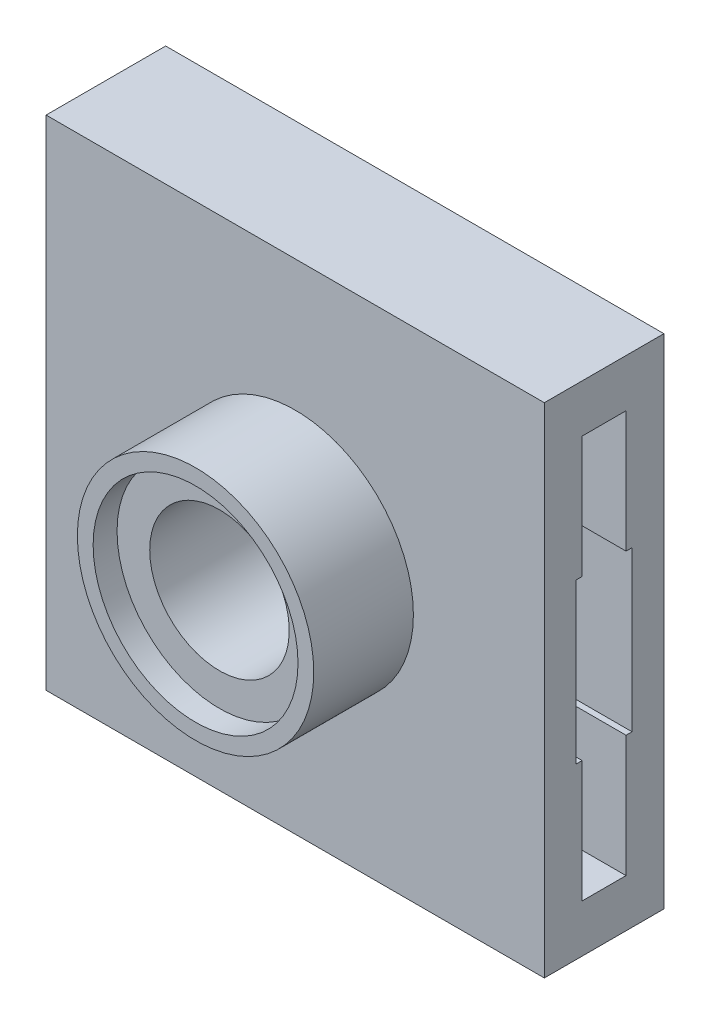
ISO-10303-21;
HEADER;
FILE_DESCRIPTION(('STEP AP214'),'2;1');
FILE_NAME('part.step','',(''),(''),'','','');
FILE_SCHEMA(('AUTOMOTIVE_DESIGN { 1 0 10303 214 1 1 1 1 }'));
ENDSEC;
DATA;
#1=APPLICATION_CONTEXT('core data for automotive mechanical design processes');
#2=APPLICATION_PROTOCOL_DEFINITION('international standard','automotive_design',2000,#1);
#3=PRODUCT_CONTEXT('',#1,'mechanical');
#4=PRODUCT('Part','Part','',(#3));
#5=PRODUCT_RELATED_PRODUCT_CATEGORY('part','',(#4));
#6=PRODUCT_DEFINITION_FORMATION('','',#4);
#7=PRODUCT_DEFINITION_CONTEXT('part definition',#1,'design');
#8=PRODUCT_DEFINITION('design','',#6,#7);
#9=PRODUCT_DEFINITION_SHAPE('','',#8);
#10=(LENGTH_UNIT() NAMED_UNIT(*) SI_UNIT(.MILLI.,.METRE.));
#11=(NAMED_UNIT(*) PLANE_ANGLE_UNIT() SI_UNIT($,.RADIAN.));
#12=(NAMED_UNIT(*) SI_UNIT($,.STERADIAN.) SOLID_ANGLE_UNIT());
#13=UNCERTAINTY_MEASURE_WITH_UNIT(LENGTH_MEASURE(1.E-05),#10,'distance_accuracy_value','');
#14=(GEOMETRIC_REPRESENTATION_CONTEXT(3) GLOBAL_UNCERTAINTY_ASSIGNED_CONTEXT((#13)) GLOBAL_UNIT_ASSIGNED_CONTEXT((#10,
#11,#12)) REPRESENTATION_CONTEXT('',''));
#15=CARTESIAN_POINT('',(0.,0.,0.));
#16=DIRECTION('',(0.,0.,1.));
#17=DIRECTION('',(1.,0.,0.));
#18=AXIS2_PLACEMENT_3D('',#15,#16,#17);
#19=CARTESIAN_POINT('',(-5.05,5.05,2.05));
#20=DIRECTION('',(1.,0.,0.));
#21=DIRECTION('',(0.,1.,0.));
#22=AXIS2_PLACEMENT_3D('',#19,#20,#21);
#23=PLANE('',#22);
#24=DIRECTION('',(0.,0.,1.));
#25=VECTOR('',#24,1.);
#26=CARTESIAN_POINT('',(-5.05,3.5,2.05));
#27=LINE('',#26,#25);
#28=CARTESIAN_POINT('',(-5.05,3.5,0.95));
#29=VERTEX_POINT('',#28);
#30=CARTESIAN_POINT('',(-5.05,3.5,2.05));
#31=VERTEX_POINT('',#30);
#32=EDGE_CURVE('E174',#29,#31,#27,.T.);
#33=ORIENTED_EDGE('',*,*,#32,.F.);
#34=DIRECTION('',(0.,-1.,0.));
#35=VECTOR('',#34,1.);
#36=CARTESIAN_POINT('',(-5.05,5.05,0.95));
#37=LINE('',#36,#35);
#38=CARTESIAN_POINT('',(-5.05,5.05,0.95));
#39=VERTEX_POINT('',#38);
#40=EDGE_CURVE('E186',#39,#29,#37,.T.);
#41=ORIENTED_EDGE('',*,*,#40,.F.);
#42=DIRECTION('',(0.,0.,-1.));
#43=VECTOR('',#42,1.);
#44=CARTESIAN_POINT('',(-5.05,5.05,2.05));
#45=LINE('',#44,#43);
#46=CARTESIAN_POINT('',(-5.05,5.05,2.05));
#47=VERTEX_POINT('',#46);
#48=EDGE_CURVE('E220',#47,#39,#45,.T.);
#49=ORIENTED_EDGE('',*,*,#48,.F.);
#50=DIRECTION('',(0.,-1.,0.));
#51=VECTOR('',#50,1.);
#52=CARTESIAN_POINT('',(-5.05,5.05,2.05));
#53=LINE('',#52,#51);
#54=EDGE_CURVE('E189',#47,#31,#53,.T.);
#55=ORIENTED_EDGE('',*,*,#54,.T.);
#56=EDGE_LOOP('',(#33,#41,#49,#55));
#57=FACE_BOUND('',#56,.T.);
#58=ADVANCED_FACE('F32',(#57),#23,.T.);
#59=CARTESIAN_POINT('',(-6.25,-6.25,3.));
#60=DIRECTION('',(1.,0.,0.));
#61=DIRECTION('',(0.,0.,-1.));
#62=AXIS2_PLACEMENT_3D('',#59,#60,#61);
#63=PLANE('',#62);
#64=DIRECTION('',(0.,-1.,0.));
#65=VECTOR('',#64,1.);
#66=CARTESIAN_POINT('',(-6.25,-6.25,0.));
#67=LINE('',#66,#65);
#68=CARTESIAN_POINT('',(-6.25,6.25,0.));
#69=VERTEX_POINT('',#68);
#70=CARTESIAN_POINT('',(-6.25,-6.25,0.));
#71=VERTEX_POINT('',#70);
#72=EDGE_CURVE('E241',#69,#71,#67,.T.);
#73=ORIENTED_EDGE('',*,*,#72,.T.);
#74=DIRECTION('',(0.,0.,-1.));
#75=VECTOR('',#74,1.);
#76=CARTESIAN_POINT('',(-6.25,-6.25,3.));
#77=LINE('',#76,#75);
#78=CARTESIAN_POINT('',(-6.25,-6.25,3.));
#79=VERTEX_POINT('',#78);
#80=EDGE_CURVE('E270',#79,#71,#77,.T.);
#81=ORIENTED_EDGE('',*,*,#80,.F.);
#82=DIRECTION('',(0.,-1.,0.));
#83=VECTOR('',#82,1.);
#84=CARTESIAN_POINT('',(-6.25,-6.25,3.));
#85=LINE('',#84,#83);
#86=CARTESIAN_POINT('',(-6.25,6.25,3.));
#87=VERTEX_POINT('',#86);
#88=EDGE_CURVE('E244',#87,#79,#85,.T.);
#89=ORIENTED_EDGE('',*,*,#88,.F.);
#90=DIRECTION('',(0.,0.,-1.));
#91=VECTOR('',#90,1.);
#92=CARTESIAN_POINT('',(-6.25,6.25,3.));
#93=LINE('',#92,#91);
#94=EDGE_CURVE('E254',#87,#69,#93,.T.);
#95=ORIENTED_EDGE('',*,*,#94,.T.);
#96=EDGE_LOOP('',(#73,#81,#89,#95));
#97=FACE_BOUND('',#96,.T.);
#98=DIRECTION('',(0.,1.,0.));
#99=VECTOR('',#98,1.);
#100=CARTESIAN_POINT('',(-6.25,3.5,0.95));
#101=LINE('',#100,#99);
#102=CARTESIAN_POINT('',(-6.25,-3.5,0.95));
#103=VERTEX_POINT('',#102);
#104=CARTESIAN_POINT('',(-6.25,3.5,0.95));
#105=VERTEX_POINT('',#104);
#106=EDGE_CURVE('E57',#103,#105,#101,.T.);
#107=ORIENTED_EDGE('',*,*,#106,.T.);
#108=DIRECTION('',(0.,0.,1.));
#109=VECTOR('',#108,1.);
#110=CARTESIAN_POINT('',(-6.25,3.5,2.05));
#111=LINE('',#110,#109);
#112=CARTESIAN_POINT('',(-6.25,3.5,2.05));
#113=VERTEX_POINT('',#112);
#114=EDGE_CURVE('E177',#105,#113,#111,.T.);
#115=ORIENTED_EDGE('',*,*,#114,.T.);
#116=DIRECTION('',(0.,-1.,0.));
#117=VECTOR('',#116,1.);
#118=CARTESIAN_POINT('',(-6.25,3.5,2.05));
#119=LINE('',#118,#117);
#120=CARTESIAN_POINT('',(-6.25,-3.5,2.05));
#121=VERTEX_POINT('',#120);
#122=EDGE_CURVE('E300',#113,#121,#119,.T.);
#123=ORIENTED_EDGE('',*,*,#122,.T.);
#124=DIRECTION('',(0.,0.,-1.));
#125=VECTOR('',#124,1.);
#126=CARTESIAN_POINT('',(-6.25,-3.5,2.05));
#127=LINE('',#126,#125);
#128=EDGE_CURVE('E191',#121,#103,#127,.T.);
#129=ORIENTED_EDGE('',*,*,#128,.T.);
#130=EDGE_LOOP('',(#107,#115,#123,#129));
#131=FACE_BOUND('',#130,.T.);
#132=ADVANCED_FACE('F34',(#97,#131),#63,.F.);
#133=CARTESIAN_POINT('',(6.25,-6.25,3.));
#134=DIRECTION('',(-1.,0.,0.));
#135=DIRECTION('',(0.,0.,1.));
#136=AXIS2_PLACEMENT_3D('',#133,#134,#135);
#137=PLANE('',#136);
#138=DIRECTION('',(0.,1.,0.));
#139=VECTOR('',#138,1.);
#140=CARTESIAN_POINT('',(6.25,-6.25,0.));
#141=LINE('',#140,#139);
#142=CARTESIAN_POINT('',(6.25,-6.25,0.));
#143=VERTEX_POINT('',#142);
#144=CARTESIAN_POINT('',(6.25,6.25,0.));
#145=VERTEX_POINT('',#144);
#146=EDGE_CURVE('E259',#143,#145,#141,.T.);
#147=ORIENTED_EDGE('',*,*,#146,.T.);
#148=DIRECTION('',(0.,0.,-1.));
#149=VECTOR('',#148,1.);
#150=CARTESIAN_POINT('',(6.25,6.25,3.));
#151=LINE('',#150,#149);
#152=CARTESIAN_POINT('',(6.25,6.25,3.));
#153=VERTEX_POINT('',#152);
#154=EDGE_CURVE('E264',#153,#145,#151,.T.);
#155=ORIENTED_EDGE('',*,*,#154,.F.);
#156=DIRECTION('',(0.,1.,0.));
#157=VECTOR('',#156,1.);
#158=CARTESIAN_POINT('',(6.25,-6.25,3.));
#159=LINE('',#158,#157);
#160=CARTESIAN_POINT('',(6.25,-6.25,3.));
#161=VERTEX_POINT('',#160);
#162=EDGE_CURVE('E250',#161,#153,#159,.T.);
#163=ORIENTED_EDGE('',*,*,#162,.F.);
#164=DIRECTION('',(0.,0.,-1.));
#165=VECTOR('',#164,1.);
#166=CARTESIAN_POINT('',(6.25,-6.25,3.));
#167=LINE('',#166,#165);
#168=EDGE_CURVE('E267',#161,#143,#167,.T.);
#169=ORIENTED_EDGE('',*,*,#168,.T.);
#170=EDGE_LOOP('',(#147,#155,#163,#169));
#171=FACE_BOUND('',#170,.T.);
#172=DIRECTION('',(0.,0.,-1.));
#173=VECTOR('',#172,1.);
#174=CARTESIAN_POINT('',(6.25,2.,2.2));
#175=LINE('',#174,#173);
#176=CARTESIAN_POINT('',(6.25,2.,2.2));
#177=VERTEX_POINT('',#176);
#178=CARTESIAN_POINT('',(6.25,2.,2.05));
#179=VERTEX_POINT('',#178);
#180=EDGE_CURVE('E340',#177,#179,#175,.T.);
#181=ORIENTED_EDGE('',*,*,#180,.T.);
#182=DIRECTION('',(0.,1.,0.));
#183=VECTOR('',#182,1.);
#184=CARTESIAN_POINT('',(6.25,5.05,2.05));
#185=LINE('',#184,#183);
#186=CARTESIAN_POINT('',(6.25,5.05,2.05));
#187=VERTEX_POINT('',#186);
#188=EDGE_CURVE('E214',#179,#187,#185,.T.);
#189=ORIENTED_EDGE('',*,*,#188,.T.);
#190=DIRECTION('',(0.,0.,-1.));
#191=VECTOR('',#190,1.);
#192=CARTESIAN_POINT('',(6.25,5.05,2.05));
#193=LINE('',#192,#191);
#194=CARTESIAN_POINT('',(6.25,5.05,0.95));
#195=VERTEX_POINT('',#194);
#196=EDGE_CURVE('E222',#187,#195,#193,.T.);
#197=ORIENTED_EDGE('',*,*,#196,.T.);
#198=DIRECTION('',(0.,1.,0.));
#199=VECTOR('',#198,1.);
#200=CARTESIAN_POINT('',(6.25,5.05,0.95));
#201=LINE('',#200,#199);
#202=CARTESIAN_POINT('',(6.25,2.,0.95));
#203=VERTEX_POINT('',#202);
#204=EDGE_CURVE('E200',#203,#195,#201,.T.);
#205=ORIENTED_EDGE('',*,*,#204,.F.);
#206=CARTESIAN_POINT('',(6.25,2.,0.8));
#207=VERTEX_POINT('',#206);
#208=EDGE_CURVE('E339',#203,#207,#175,.T.);
#209=ORIENTED_EDGE('',*,*,#208,.T.);
#210=DIRECTION('',(0.,1.,0.));
#211=VECTOR('',#210,1.);
#212=CARTESIAN_POINT('',(6.25,2.,0.8));
#213=LINE('',#212,#211);
#214=CARTESIAN_POINT('',(6.25,-2.,0.8));
#215=VERTEX_POINT('',#214);
#216=EDGE_CURVE('E179',#215,#207,#213,.T.);
#217=ORIENTED_EDGE('',*,*,#216,.F.);
#218=DIRECTION('',(0.,0.,-1.));
#219=VECTOR('',#218,1.);
#220=CARTESIAN_POINT('',(6.25,-2.,2.2));
#221=LINE('',#220,#219);
#222=CARTESIAN_POINT('',(6.25,-2.,0.95));
#223=VERTEX_POINT('',#222);
#224=EDGE_CURVE('E328',#223,#215,#221,.T.);
#225=ORIENTED_EDGE('',*,*,#224,.F.);
#226=CARTESIAN_POINT('',(6.25,-5.05,0.95));
#227=VERTEX_POINT('',#226);
#228=EDGE_CURVE('E206',#227,#223,#201,.T.);
#229=ORIENTED_EDGE('',*,*,#228,.F.);
#230=DIRECTION('',(0.,0.,-1.));
#231=VECTOR('',#230,1.);
#232=CARTESIAN_POINT('',(6.25,-5.05,2.05));
#233=LINE('',#232,#231);
#234=CARTESIAN_POINT('',(6.25,-5.05,2.05));
#235=VERTEX_POINT('',#234);
#236=EDGE_CURVE('E225',#235,#227,#233,.T.);
#237=ORIENTED_EDGE('',*,*,#236,.F.);
#238=CARTESIAN_POINT('',(6.25,-2.,2.05));
#239=VERTEX_POINT('',#238);
#240=EDGE_CURVE('E215',#235,#239,#185,.T.);
#241=ORIENTED_EDGE('',*,*,#240,.T.);
#242=CARTESIAN_POINT('',(6.25,-2.,2.2));
#243=VERTEX_POINT('',#242);
#244=EDGE_CURVE('E329',#243,#239,#221,.T.);
#245=ORIENTED_EDGE('',*,*,#244,.F.);
#246=DIRECTION('',(0.,1.,0.));
#247=VECTOR('',#246,1.);
#248=CARTESIAN_POINT('',(6.25,2.,2.2));
#249=LINE('',#248,#247);
#250=EDGE_CURVE('E319',#243,#177,#249,.T.);
#251=ORIENTED_EDGE('',*,*,#250,.T.);
#252=EDGE_LOOP('',(#181,#189,#197,#205,#209,#217,#225,#229,#237,#241,#245,#251));
#253=FACE_BOUND('',#252,.T.);
#254=ADVANCED_FACE('F355',(#171,#253),#137,.F.);
#255=CARTESIAN_POINT('',(0.,0.,-2.5));
#256=DIRECTION('',(0.,0.,1.));
#257=DIRECTION('',(1.,0.,0.));
#258=AXIS2_PLACEMENT_3D('',#255,#256,#257);
#259=CYLINDRICAL_SURFACE('',#258,1.75);
#260=CARTESIAN_POINT('',(0.,0.,4.9));
#261=DIRECTION('',(0.,0.,-1.));
#262=DIRECTION('',(-1.,0.,0.));
#263=AXIS2_PLACEMENT_3D('',#260,#261,#262);
#264=CIRCLE('',#263,1.75);
#265=CARTESIAN_POINT('',(-1.75,0.,4.9));
#266=VERTEX_POINT('',#265);
#267=EDGE_CURVE('E36',#266,#266,#264,.F.);
#268=ORIENTED_EDGE('',*,*,#267,.T.);
#269=EDGE_LOOP('',(#268));
#270=FACE_BOUND('',#269,.T.);
#271=CARTESIAN_POINT('',(0.,0.,2.2));
#272=DIRECTION('',(0.,0.,-1.));
#273=DIRECTION('',(-1.,0.,0.));
#274=AXIS2_PLACEMENT_3D('',#271,#272,#273);
#275=CIRCLE('',#274,1.75);
#276=CARTESIAN_POINT('',(-1.75,0.,2.2));
#277=VERTEX_POINT('',#276);
#278=EDGE_CURVE('E277',#277,#277,#275,.F.);
#279=ORIENTED_EDGE('',*,*,#278,.F.);
#280=EDGE_LOOP('',(#279));
#281=FACE_BOUND('',#280,.T.);
#282=ADVANCED_FACE('F404',(#270,#281),#259,.F.);
#283=CARTESIAN_POINT('',(0.,0.,2.05));
#284=DIRECTION('',(0.,0.,1.));
#285=DIRECTION('',(1.,0.,0.));
#286=AXIS2_PLACEMENT_3D('',#283,#284,#285);
#287=PLANE('',#286);
#288=DIRECTION('',(1.,0.,0.));
#289=VECTOR('',#288,1.);
#290=CARTESIAN_POINT('',(0.,2.,2.05));
#291=LINE('',#290,#289);
#292=CARTESIAN_POINT('',(-3.25,2.,2.05));
#293=VERTEX_POINT('',#292);
#294=EDGE_CURVE('E279',#293,#179,#291,.T.);
#295=ORIENTED_EDGE('',*,*,#294,.F.);
#296=DIRECTION('',(0.,1.,0.));
#297=VECTOR('',#296,1.);
#298=CARTESIAN_POINT('',(-3.25,0.,2.05));
#299=LINE('',#298,#297);
#300=CARTESIAN_POINT('',(-3.25,-2.,2.05));
#301=VERTEX_POINT('',#300);
#302=EDGE_CURVE('E345',#301,#293,#299,.T.);
#303=ORIENTED_EDGE('',*,*,#302,.F.);
#304=DIRECTION('',(-1.,0.,0.));
#305=VECTOR('',#304,1.);
#306=CARTESIAN_POINT('',(0.,-2.,2.05));
#307=LINE('',#306,#305);
#308=EDGE_CURVE('E343',#239,#301,#307,.T.);
#309=ORIENTED_EDGE('',*,*,#308,.F.);
#310=ORIENTED_EDGE('',*,*,#240,.F.);
#311=DIRECTION('',(1.,0.,0.));
#312=VECTOR('',#311,1.);
#313=CARTESIAN_POINT('',(-5.05,-5.05,2.05));
#314=LINE('',#313,#312);
#315=CARTESIAN_POINT('',(-5.05,-5.05,2.05));
#316=VERTEX_POINT('',#315);
#317=EDGE_CURVE('E212',#316,#235,#314,.T.);
#318=ORIENTED_EDGE('',*,*,#317,.F.);
#319=CARTESIAN_POINT('',(-5.05,-3.5,2.05));
#320=VERTEX_POINT('',#319);
#321=EDGE_CURVE('E210',#320,#316,#53,.T.);
#322=ORIENTED_EDGE('',*,*,#321,.F.);
#323=DIRECTION('',(-1.,0.,0.));
#324=VECTOR('',#323,1.);
#325=CARTESIAN_POINT('',(-5.05,-3.5,2.05));
#326=LINE('',#325,#324);
#327=EDGE_CURVE('E49',#320,#121,#326,.T.);
#328=ORIENTED_EDGE('',*,*,#327,.T.);
#329=ORIENTED_EDGE('',*,*,#122,.F.);
#330=DIRECTION('',(-1.,0.,0.));
#331=VECTOR('',#330,1.);
#332=CARTESIAN_POINT('',(-5.05,3.5,2.05));
#333=LINE('',#332,#331);
#334=EDGE_CURVE('E180',#31,#113,#333,.T.);
#335=ORIENTED_EDGE('',*,*,#334,.F.);
#336=ORIENTED_EDGE('',*,*,#54,.F.);
#337=DIRECTION('',(-1.,0.,0.));
#338=VECTOR('',#337,1.);
#339=CARTESIAN_POINT('',(-5.05,5.05,2.05));
#340=LINE('',#339,#338);
#341=EDGE_CURVE('E218',#187,#47,#340,.T.);
#342=ORIENTED_EDGE('',*,*,#341,.F.);
#343=ORIENTED_EDGE('',*,*,#188,.F.);
#344=EDGE_LOOP('',(#295,#303,#309,#310,#318,#322,#328,#329,#335,#336,#342,#343));
#345=FACE_BOUND('',#344,.T.);
#346=ADVANCED_FACE('F360',(#345),#287,.F.);
#347=CARTESIAN_POINT('',(0.,0.,0.95));
#348=DIRECTION('',(0.,0.,1.));
#349=DIRECTION('',(1.,0.,0.));
#350=AXIS2_PLACEMENT_3D('',#347,#348,#349);
#351=PLANE('',#350);
#352=DIRECTION('',(0.,1.,0.));
#353=VECTOR('',#352,1.);
#354=CARTESIAN_POINT('',(-3.25,0.,0.95));
#355=LINE('',#354,#353);
#356=CARTESIAN_POINT('',(-3.25,-2.,0.95));
#357=VERTEX_POINT('',#356);
#358=CARTESIAN_POINT('',(-3.25,2.,0.95));
#359=VERTEX_POINT('',#358);
#360=EDGE_CURVE('E41',#357,#359,#355,.T.);
#361=ORIENTED_EDGE('',*,*,#360,.T.);
#362=DIRECTION('',(1.,0.,0.));
#363=VECTOR('',#362,1.);
#364=CARTESIAN_POINT('',(0.,2.,0.95));
#365=LINE('',#364,#363);
#366=EDGE_CURVE('E11',#359,#203,#365,.T.);
#367=ORIENTED_EDGE('',*,*,#366,.T.);
#368=ORIENTED_EDGE('',*,*,#204,.T.);
#369=DIRECTION('',(-1.,0.,0.));
#370=VECTOR('',#369,1.);
#371=CARTESIAN_POINT('',(-5.05,5.05,0.95));
#372=LINE('',#371,#370);
#373=EDGE_CURVE('E196',#195,#39,#372,.T.);
#374=ORIENTED_EDGE('',*,*,#373,.T.);
#375=ORIENTED_EDGE('',*,*,#40,.T.);
#376=DIRECTION('',(-1.,0.,0.));
#377=VECTOR('',#376,1.);
#378=CARTESIAN_POINT('',(-5.05,3.5,0.95));
#379=LINE('',#378,#377);
#380=EDGE_CURVE('E171',#29,#105,#379,.T.);
#381=ORIENTED_EDGE('',*,*,#380,.T.);
#382=ORIENTED_EDGE('',*,*,#106,.F.);
#383=DIRECTION('',(-1.,0.,0.));
#384=VECTOR('',#383,1.);
#385=CARTESIAN_POINT('',(-5.05,-3.5,0.949999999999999));
#386=LINE('',#385,#384);
#387=CARTESIAN_POINT('',(-5.05,-3.5,0.949999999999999));
#388=VERTEX_POINT('',#387);
#389=EDGE_CURVE('E297',#388,#103,#386,.T.);
#390=ORIENTED_EDGE('',*,*,#389,.F.);
#391=CARTESIAN_POINT('',(-5.05,-5.05,0.95));
#392=VERTEX_POINT('',#391);
#393=EDGE_CURVE('E198',#388,#392,#37,.T.);
#394=ORIENTED_EDGE('',*,*,#393,.T.);
#395=DIRECTION('',(1.,0.,0.));
#396=VECTOR('',#395,1.);
#397=CARTESIAN_POINT('',(-5.05,-5.05,0.95));
#398=LINE('',#397,#396);
#399=EDGE_CURVE('E197',#392,#227,#398,.T.);
#400=ORIENTED_EDGE('',*,*,#399,.T.);
#401=ORIENTED_EDGE('',*,*,#228,.T.);
#402=DIRECTION('',(-1.,0.,0.));
#403=VECTOR('',#402,1.);
#404=CARTESIAN_POINT('',(0.,-2.,0.95));
#405=LINE('',#404,#403);
#406=EDGE_CURVE('E273',#223,#357,#405,.T.);
#407=ORIENTED_EDGE('',*,*,#406,.T.);
#408=EDGE_LOOP('',(#361,#367,#368,#374,#375,#381,#382,#390,#394,#400,#401,#407));
#409=FACE_BOUND('',#408,.T.);
#410=ADVANCED_FACE('F194',(#409),#351,.T.);
#411=CARTESIAN_POINT('',(0.,0.,-1.9));
#412=DIRECTION('',(0.,0.,1.));
#413=DIRECTION('',(1.,0.,0.));
#414=AXIS2_PLACEMENT_3D('',#411,#412,#413);
#415=CIRCLE('',#414,1.75);
#416=CARTESIAN_POINT('',(1.75,0.,-1.9));
#417=VERTEX_POINT('',#416);
#418=EDGE_CURVE('E280',#417,#417,#415,.F.);
#419=ORIENTED_EDGE('',*,*,#418,.T.);
#420=EDGE_LOOP('',(#419));
#421=FACE_BOUND('',#420,.T.);
#422=CARTESIAN_POINT('',(0.,0.,0.8));
#423=DIRECTION('',(0.,0.,-1.));
#424=DIRECTION('',(-1.,0.,0.));
#425=AXIS2_PLACEMENT_3D('',#422,#423,#424);
#426=CIRCLE('',#425,1.75);
#427=CARTESIAN_POINT('',(-1.75,0.,0.8));
#428=VERTEX_POINT('',#427);
#429=EDGE_CURVE('E202',#428,#428,#426,.F.);
#430=ORIENTED_EDGE('',*,*,#429,.T.);
#431=EDGE_LOOP('',(#430));
#432=FACE_BOUND('',#431,.T.);
#433=ADVANCED_FACE('F408',(#421,#432),#259,.F.);
#434=CARTESIAN_POINT('',(6.25,-6.25,3.));
#435=DIRECTION('',(0.,1.,0.));
#436=DIRECTION('',(-1.,0.,0.));
#437=AXIS2_PLACEMENT_3D('',#434,#435,#436);
#438=PLANE('',#437);
#439=DIRECTION('',(1.,0.,0.));
#440=VECTOR('',#439,1.);
#441=CARTESIAN_POINT('',(6.25,-6.25,0.));
#442=LINE('',#441,#440);
#443=EDGE_CURVE('E257',#71,#143,#442,.T.);
#444=ORIENTED_EDGE('',*,*,#443,.T.);
#445=ORIENTED_EDGE('',*,*,#168,.F.);
#446=DIRECTION('',(1.,0.,0.));
#447=VECTOR('',#446,1.);
#448=CARTESIAN_POINT('',(6.25,-6.25,3.));
#449=LINE('',#448,#447);
#450=EDGE_CURVE('E247',#79,#161,#449,.T.);
#451=ORIENTED_EDGE('',*,*,#450,.F.);
#452=ORIENTED_EDGE('',*,*,#80,.T.);
#453=EDGE_LOOP('',(#444,#445,#451,#452));
#454=FACE_BOUND('',#453,.T.);
#455=ADVANCED_FACE('F420',(#454),#438,.F.);
#456=CARTESIAN_POINT('',(6.25,6.25,3.));
#457=DIRECTION('',(0.,-1.,0.));
#458=DIRECTION('',(1.,0.,0.));
#459=AXIS2_PLACEMENT_3D('',#456,#457,#458);
#460=PLANE('',#459);
#461=DIRECTION('',(-1.,0.,0.));
#462=VECTOR('',#461,1.);
#463=CARTESIAN_POINT('',(6.25,6.25,0.));
#464=LINE('',#463,#462);
#465=EDGE_CURVE('E248',#145,#69,#464,.T.);
#466=ORIENTED_EDGE('',*,*,#465,.T.);
#467=ORIENTED_EDGE('',*,*,#94,.F.);
#468=DIRECTION('',(-1.,0.,0.));
#469=VECTOR('',#468,1.);
#470=CARTESIAN_POINT('',(6.25,6.25,3.));
#471=LINE('',#470,#469);
#472=EDGE_CURVE('E252',#153,#87,#471,.T.);
#473=ORIENTED_EDGE('',*,*,#472,.F.);
#474=ORIENTED_EDGE('',*,*,#154,.T.);
#475=EDGE_LOOP('',(#466,#467,#473,#474));
#476=FACE_BOUND('',#475,.T.);
#477=ADVANCED_FACE('F608',(#476),#460,.F.);
#478=CARTESIAN_POINT('',(0.,0.,3.));
#479=DIRECTION('',(0.,0.,1.));
#480=DIRECTION('',(1.,0.,0.));
#481=AXIS2_PLACEMENT_3D('',#478,#479,#480);
#482=PLANE('',#481);
#483=CARTESIAN_POINT('',(0.,0.,3.));
#484=DIRECTION('',(0.,0.,1.));
#485=DIRECTION('',(1.,0.,0.));
#486=AXIS2_PLACEMENT_3D('',#483,#484,#485);
#487=CIRCLE('',#486,2.965);
#488=CARTESIAN_POINT('',(2.965,0.,3.));
#489=VERTEX_POINT('',#488);
#490=EDGE_CURVE('E231',#489,#489,#487,.T.);
#491=ORIENTED_EDGE('',*,*,#490,.F.);
#492=EDGE_LOOP('',(#491));
#493=FACE_BOUND('',#492,.T.);
#494=ORIENTED_EDGE('',*,*,#88,.T.);
#495=ORIENTED_EDGE('',*,*,#450,.T.);
#496=ORIENTED_EDGE('',*,*,#162,.T.);
#497=ORIENTED_EDGE('',*,*,#472,.T.);
#498=EDGE_LOOP('',(#494,#495,#496,#497));
#499=FACE_BOUND('',#498,.T.);
#500=ADVANCED_FACE('F604',(#493,#499),#482,.T.);
#501=CARTESIAN_POINT('',(0.,0.,0.));
#502=DIRECTION('',(0.,0.,1.));
#503=DIRECTION('',(1.,0.,0.));
#504=AXIS2_PLACEMENT_3D('',#501,#502,#503);
#505=PLANE('',#504);
#506=CARTESIAN_POINT('',(0.,0.,0.));
#507=DIRECTION('',(0.,0.,1.));
#508=DIRECTION('',(1.,0.,0.));
#509=AXIS2_PLACEMENT_3D('',#506,#507,#508);
#510=CIRCLE('',#509,2.965);
#511=CARTESIAN_POINT('',(2.965,0.,0.));
#512=VERTEX_POINT('',#511);
#513=EDGE_CURVE('E235',#512,#512,#510,.T.);
#514=ORIENTED_EDGE('',*,*,#513,.T.);
#515=EDGE_LOOP('',(#514));
#516=FACE_BOUND('',#515,.T.);
#517=ORIENTED_EDGE('',*,*,#72,.F.);
#518=ORIENTED_EDGE('',*,*,#465,.F.);
#519=ORIENTED_EDGE('',*,*,#146,.F.);
#520=ORIENTED_EDGE('',*,*,#443,.F.);
#521=EDGE_LOOP('',(#517,#518,#519,#520));
#522=FACE_BOUND('',#521,.T.);
#523=ADVANCED_FACE('F607',(#516,#522),#505,.F.);
#524=CARTESIAN_POINT('',(0.,0.,-2.5));
#525=DIRECTION('',(0.,0.,1.));
#526=DIRECTION('',(1.,0.,0.));
#527=AXIS2_PLACEMENT_3D('',#524,#525,#526);
#528=CYLINDRICAL_SURFACE('',#527,2.965);
#529=CARTESIAN_POINT('',(0.,0.,-2.5));
#530=DIRECTION('',(0.,0.,1.));
#531=DIRECTION('',(1.,0.,0.));
#532=AXIS2_PLACEMENT_3D('',#529,#530,#531);
#533=CIRCLE('',#532,2.965);
#534=CARTESIAN_POINT('',(2.965,0.,-2.5));
#535=VERTEX_POINT('',#534);
#536=EDGE_CURVE('E238',#535,#535,#533,.T.);
#537=ORIENTED_EDGE('',*,*,#536,.T.);
#538=EDGE_LOOP('',(#537));
#539=FACE_BOUND('',#538,.T.);
#540=ORIENTED_EDGE('',*,*,#513,.F.);
#541=EDGE_LOOP('',(#540));
#542=FACE_BOUND('',#541,.T.);
#543=ADVANCED_FACE('F538',(#539,#542),#528,.T.);
#544=CARTESIAN_POINT('',(0.,0.,-2.5));
#545=DIRECTION('',(0.,0.,1.));
#546=DIRECTION('',(1.,0.,0.));
#547=AXIS2_PLACEMENT_3D('',#544,#545,#546);
#548=PLANE('',#547);
#549=CARTESIAN_POINT('',(0.,0.,-2.5));
#550=DIRECTION('',(0.,0.,1.));
#551=DIRECTION('',(1.,0.,0.));
#552=AXIS2_PLACEMENT_3D('',#549,#550,#551);
#553=CIRCLE('',#552,2.57);
#554=CARTESIAN_POINT('',(2.57,0.,-2.5));
#555=VERTEX_POINT('',#554);
#556=EDGE_CURVE('E287',#555,#555,#553,.T.);
#557=ORIENTED_EDGE('',*,*,#556,.T.);
#558=EDGE_LOOP('',(#557));
#559=FACE_BOUND('',#558,.T.);
#560=ORIENTED_EDGE('',*,*,#536,.F.);
#561=EDGE_LOOP('',(#560));
#562=FACE_BOUND('',#561,.T.);
#563=ADVANCED_FACE('F533',(#559,#562),#548,.F.);
#564=CARTESIAN_POINT('',(0.,0.,5.5));
#565=DIRECTION('',(0.,0.,-1.));
#566=DIRECTION('',(1.,0.,0.));
#567=AXIS2_PLACEMENT_3D('',#564,#565,#566);
#568=PLANE('',#567);
#569=CARTESIAN_POINT('',(0.,0.,5.5));
#570=DIRECTION('',(0.,0.,1.));
#571=DIRECTION('',(1.,0.,0.));
#572=AXIS2_PLACEMENT_3D('',#569,#570,#571);
#573=CIRCLE('',#572,2.57);
#574=CARTESIAN_POINT('',(2.57,0.,5.5));
#575=VERTEX_POINT('',#574);
#576=EDGE_CURVE('E294',#575,#575,#573,.T.);
#577=ORIENTED_EDGE('',*,*,#576,.F.);
#578=EDGE_LOOP('',(#577));
#579=FACE_BOUND('',#578,.T.);
#580=CARTESIAN_POINT('',(0.,0.,5.5));
#581=DIRECTION('',(0.,0.,1.));
#582=DIRECTION('',(1.,0.,0.));
#583=AXIS2_PLACEMENT_3D('',#580,#581,#582);
#584=CIRCLE('',#583,2.965);
#585=CARTESIAN_POINT('',(2.965,0.,5.5));
#586=VERTEX_POINT('',#585);
#587=EDGE_CURVE('E232',#586,#586,#584,.T.);
#588=ORIENTED_EDGE('',*,*,#587,.T.);
#589=EDGE_LOOP('',(#588));
#590=FACE_BOUND('',#589,.T.);
#591=ADVANCED_FACE('F437',(#579,#590),#568,.F.);
#592=CARTESIAN_POINT('',(0.,0.,5.5));
#593=DIRECTION('',(0.,0.,-1.));
#594=DIRECTION('',(-1.,0.,0.));
#595=AXIS2_PLACEMENT_3D('',#592,#593,#594);
#596=CYLINDRICAL_SURFACE('',#595,2.965);
#597=ORIENTED_EDGE('',*,*,#587,.F.);
#598=EDGE_LOOP('',(#597));
#599=FACE_BOUND('',#598,.T.);
#600=ORIENTED_EDGE('',*,*,#490,.T.);
#601=EDGE_LOOP('',(#600));
#602=FACE_BOUND('',#601,.T.);
#603=ADVANCED_FACE('F431',(#599,#602),#596,.T.);
#604=DIRECTION('',(0.,0.,-1.));
#605=VECTOR('',#604,1.);
#606=CARTESIAN_POINT('',(-5.05,-3.5,2.05));
#607=LINE('',#606,#605);
#608=EDGE_CURVE('E190',#320,#388,#607,.T.);
#609=ORIENTED_EDGE('',*,*,#608,.F.);
#610=ORIENTED_EDGE('',*,*,#321,.T.);
#611=DIRECTION('',(0.,0.,-1.));
#612=VECTOR('',#611,1.);
#613=CARTESIAN_POINT('',(-5.05,-5.05,2.05));
#614=LINE('',#613,#612);
#615=EDGE_CURVE('E228',#316,#392,#614,.T.);
#616=ORIENTED_EDGE('',*,*,#615,.T.);
#617=ORIENTED_EDGE('',*,*,#393,.F.);
#618=EDGE_LOOP('',(#609,#610,#616,#617));
#619=FACE_BOUND('',#618,.T.);
#620=ADVANCED_FACE('F423',(#619),#23,.T.);
#621=CARTESIAN_POINT('',(-5.05,-5.05,2.05));
#622=DIRECTION('',(0.,1.,0.));
#623=DIRECTION('',(0.,0.,1.));
#624=AXIS2_PLACEMENT_3D('',#621,#622,#623);
#625=PLANE('',#624);
#626=ORIENTED_EDGE('',*,*,#615,.F.);
#627=ORIENTED_EDGE('',*,*,#317,.T.);
#628=ORIENTED_EDGE('',*,*,#236,.T.);
#629=ORIENTED_EDGE('',*,*,#399,.F.);
#630=EDGE_LOOP('',(#626,#627,#628,#629));
#631=FACE_BOUND('',#630,.T.);
#632=ADVANCED_FACE('F385',(#631),#625,.T.);
#633=CARTESIAN_POINT('',(-5.05,5.05,2.05));
#634=DIRECTION('',(0.,-1.,0.));
#635=DIRECTION('',(0.,0.,-1.));
#636=AXIS2_PLACEMENT_3D('',#633,#634,#635);
#637=PLANE('',#636);
#638=ORIENTED_EDGE('',*,*,#196,.F.);
#639=ORIENTED_EDGE('',*,*,#341,.T.);
#640=ORIENTED_EDGE('',*,*,#48,.T.);
#641=ORIENTED_EDGE('',*,*,#373,.F.);
#642=EDGE_LOOP('',(#638,#639,#640,#641));
#643=FACE_BOUND('',#642,.T.);
#644=ADVANCED_FACE('F362',(#643),#637,.T.);
#645=CARTESIAN_POINT('',(6.25,-2.,2.2));
#646=DIRECTION('',(0.,1.,0.));
#647=DIRECTION('',(-1.,0.,0.));
#648=AXIS2_PLACEMENT_3D('',#645,#646,#647);
#649=PLANE('',#648);
#650=ORIENTED_EDGE('',*,*,#224,.T.);
#651=DIRECTION('',(1.,0.,0.));
#652=VECTOR('',#651,1.);
#653=CARTESIAN_POINT('',(6.25,-2.,0.8));
#654=LINE('',#653,#652);
#655=CARTESIAN_POINT('',(-3.25,-2.,0.8));
#656=VERTEX_POINT('',#655);
#657=EDGE_CURVE('E316',#656,#215,#654,.T.);
#658=ORIENTED_EDGE('',*,*,#657,.F.);
#659=DIRECTION('',(0.,0.,-1.));
#660=VECTOR('',#659,1.);
#661=CARTESIAN_POINT('',(-3.25,-2.,2.2));
#662=LINE('',#661,#660);
#663=EDGE_CURVE('E331',#357,#656,#662,.T.);
#664=ORIENTED_EDGE('',*,*,#663,.F.);
#665=ORIENTED_EDGE('',*,*,#406,.F.);
#666=EDGE_LOOP('',(#650,#658,#664,#665));
#667=FACE_BOUND('',#666,.T.);
#668=ADVANCED_FACE('F457',(#667),#649,.T.);
#669=CARTESIAN_POINT('',(-3.25,2.,2.2));
#670=DIRECTION('',(1.,0.,0.));
#671=DIRECTION('',(0.,1.,0.));
#672=AXIS2_PLACEMENT_3D('',#669,#670,#671);
#673=PLANE('',#672);
#674=ORIENTED_EDGE('',*,*,#663,.T.);
#675=DIRECTION('',(0.,-1.,0.));
#676=VECTOR('',#675,1.);
#677=CARTESIAN_POINT('',(-3.25,2.,0.8));
#678=LINE('',#677,#676);
#679=CARTESIAN_POINT('',(-3.25,2.,0.8));
#680=VERTEX_POINT('',#679);
#681=EDGE_CURVE('E313',#680,#656,#678,.T.);
#682=ORIENTED_EDGE('',*,*,#681,.F.);
#683=DIRECTION('',(0.,0.,-1.));
#684=VECTOR('',#683,1.);
#685=CARTESIAN_POINT('',(-3.25,2.,2.2));
#686=LINE('',#685,#684);
#687=EDGE_CURVE('E335',#359,#680,#686,.T.);
#688=ORIENTED_EDGE('',*,*,#687,.F.);
#689=ORIENTED_EDGE('',*,*,#360,.F.);
#690=EDGE_LOOP('',(#674,#682,#688,#689));
#691=FACE_BOUND('',#690,.T.);
#692=ADVANCED_FACE('F372',(#691),#673,.T.);
#693=CARTESIAN_POINT('',(6.25,2.,2.2));
#694=DIRECTION('',(0.,-1.,0.));
#695=DIRECTION('',(1.,0.,0.));
#696=AXIS2_PLACEMENT_3D('',#693,#694,#695);
#697=PLANE('',#696);
#698=ORIENTED_EDGE('',*,*,#687,.T.);
#699=DIRECTION('',(-1.,0.,0.));
#700=VECTOR('',#699,1.);
#701=CARTESIAN_POINT('',(6.25,2.,0.8));
#702=LINE('',#701,#700);
#703=EDGE_CURVE('E310',#207,#680,#702,.T.);
#704=ORIENTED_EDGE('',*,*,#703,.F.);
#705=ORIENTED_EDGE('',*,*,#208,.F.);
#706=ORIENTED_EDGE('',*,*,#366,.F.);
#707=EDGE_LOOP('',(#698,#704,#705,#706));
#708=FACE_BOUND('',#707,.T.);
#709=ADVANCED_FACE('F369',(#708),#697,.T.);
#710=CARTESIAN_POINT('',(0.,0.,0.8));
#711=DIRECTION('',(0.,0.,-1.));
#712=DIRECTION('',(-1.,0.,0.));
#713=AXIS2_PLACEMENT_3D('',#710,#711,#712);
#714=PLANE('',#713);
#715=ORIENTED_EDGE('',*,*,#216,.T.);
#716=ORIENTED_EDGE('',*,*,#703,.T.);
#717=ORIENTED_EDGE('',*,*,#681,.T.);
#718=ORIENTED_EDGE('',*,*,#657,.T.);
#719=EDGE_LOOP('',(#715,#716,#717,#718));
#720=FACE_BOUND('',#719,.T.);
#721=ORIENTED_EDGE('',*,*,#429,.F.);
#722=EDGE_LOOP('',(#721));
#723=FACE_BOUND('',#722,.T.);
#724=ADVANCED_FACE('F375',(#720,#723),#714,.F.);
#725=CARTESIAN_POINT('',(0.,0.,2.2));
#726=DIRECTION('',(0.,0.,-1.));
#727=DIRECTION('',(-1.,0.,0.));
#728=AXIS2_PLACEMENT_3D('',#725,#726,#727);
#729=PLANE('',#728);
#730=ORIENTED_EDGE('',*,*,#250,.F.);
#731=DIRECTION('',(1.,0.,0.));
#732=VECTOR('',#731,1.);
#733=CARTESIAN_POINT('',(6.25,-2.,2.2));
#734=LINE('',#733,#732);
#735=CARTESIAN_POINT('',(-3.25,-2.,2.2));
#736=VERTEX_POINT('',#735);
#737=EDGE_CURVE('E326',#736,#243,#734,.T.);
#738=ORIENTED_EDGE('',*,*,#737,.F.);
#739=DIRECTION('',(0.,-1.,0.));
#740=VECTOR('',#739,1.);
#741=CARTESIAN_POINT('',(-3.25,2.,2.2));
#742=LINE('',#741,#740);
#743=CARTESIAN_POINT('',(-3.25,2.,2.2));
#744=VERTEX_POINT('',#743);
#745=EDGE_CURVE('E324',#744,#736,#742,.T.);
#746=ORIENTED_EDGE('',*,*,#745,.F.);
#747=DIRECTION('',(-1.,0.,0.));
#748=VECTOR('',#747,1.);
#749=CARTESIAN_POINT('',(6.25,2.,2.2));
#750=LINE('',#749,#748);
#751=EDGE_CURVE('E322',#177,#744,#750,.T.);
#752=ORIENTED_EDGE('',*,*,#751,.F.);
#753=EDGE_LOOP('',(#730,#738,#746,#752));
#754=FACE_BOUND('',#753,.T.);
#755=ORIENTED_EDGE('',*,*,#278,.T.);
#756=EDGE_LOOP('',(#755));
#757=FACE_BOUND('',#756,.T.);
#758=ADVANCED_FACE('F398',(#754,#757),#729,.T.);
#759=ORIENTED_EDGE('',*,*,#294,.T.);
#760=ORIENTED_EDGE('',*,*,#180,.F.);
#761=ORIENTED_EDGE('',*,*,#751,.T.);
#762=EDGE_CURVE('E336',#744,#293,#686,.T.);
#763=ORIENTED_EDGE('',*,*,#762,.T.);
#764=EDGE_LOOP('',(#759,#760,#761,#763));
#765=FACE_BOUND('',#764,.T.);
#766=ADVANCED_FACE('F349',(#765),#697,.T.);
#767=ORIENTED_EDGE('',*,*,#302,.T.);
#768=ORIENTED_EDGE('',*,*,#762,.F.);
#769=ORIENTED_EDGE('',*,*,#745,.T.);
#770=EDGE_CURVE('E332',#736,#301,#662,.T.);
#771=ORIENTED_EDGE('',*,*,#770,.T.);
#772=EDGE_LOOP('',(#767,#768,#769,#771));
#773=FACE_BOUND('',#772,.T.);
#774=ADVANCED_FACE('F395',(#773),#673,.T.);
#775=ORIENTED_EDGE('',*,*,#308,.T.);
#776=ORIENTED_EDGE('',*,*,#770,.F.);
#777=ORIENTED_EDGE('',*,*,#737,.T.);
#778=ORIENTED_EDGE('',*,*,#244,.T.);
#779=EDGE_LOOP('',(#775,#776,#777,#778));
#780=FACE_BOUND('',#779,.T.);
#781=ADVANCED_FACE('F392',(#780),#649,.T.);
#782=CARTESIAN_POINT('',(-5.05,3.5,2.05));
#783=DIRECTION('',(0.,-1.,0.));
#784=DIRECTION('',(0.,0.,-1.));
#785=AXIS2_PLACEMENT_3D('',#782,#783,#784);
#786=PLANE('',#785);
#787=ORIENTED_EDGE('',*,*,#114,.F.);
#788=ORIENTED_EDGE('',*,*,#380,.F.);
#789=ORIENTED_EDGE('',*,*,#32,.T.);
#790=ORIENTED_EDGE('',*,*,#334,.T.);
#791=EDGE_LOOP('',(#787,#788,#789,#790));
#792=FACE_BOUND('',#791,.T.);
#793=ADVANCED_FACE('F173',(#792),#786,.T.);
#794=CARTESIAN_POINT('',(-5.05,-3.5,2.05));
#795=DIRECTION('',(0.,1.,0.));
#796=DIRECTION('',(0.,0.,1.));
#797=AXIS2_PLACEMENT_3D('',#794,#795,#796);
#798=PLANE('',#797);
#799=ORIENTED_EDGE('',*,*,#128,.F.);
#800=ORIENTED_EDGE('',*,*,#327,.F.);
#801=ORIENTED_EDGE('',*,*,#608,.T.);
#802=ORIENTED_EDGE('',*,*,#389,.T.);
#803=EDGE_LOOP('',(#799,#800,#801,#802));
#804=FACE_BOUND('',#803,.T.);
#805=ADVANCED_FACE('F440',(#804),#798,.T.);
#806=CARTESIAN_POINT('',(0.,0.,-1.9));
#807=DIRECTION('',(0.,0.,1.));
#808=DIRECTION('',(1.,0.,0.));
#809=AXIS2_PLACEMENT_3D('',#806,#807,#808);
#810=PLANE('',#809);
#811=CARTESIAN_POINT('',(0.,0.,-1.9));
#812=DIRECTION('',(0.,0.,1.));
#813=DIRECTION('',(1.,0.,0.));
#814=AXIS2_PLACEMENT_3D('',#811,#812,#813);
#815=CIRCLE('',#814,2.57);
#816=CARTESIAN_POINT('',(2.57,0.,-1.9));
#817=VERTEX_POINT('',#816);
#818=EDGE_CURVE('E282',#817,#817,#815,.T.);
#819=ORIENTED_EDGE('',*,*,#818,.F.);
#820=EDGE_LOOP('',(#819));
#821=FACE_BOUND('',#820,.T.);
#822=ORIENTED_EDGE('',*,*,#418,.F.);
#823=EDGE_LOOP('',(#822));
#824=FACE_BOUND('',#823,.T.);
#825=ADVANCED_FACE('F443',(#821,#824),#810,.F.);
#826=CARTESIAN_POINT('',(0.,0.,-1.9));
#827=DIRECTION('',(0.,0.,-1.));
#828=DIRECTION('',(-1.,0.,0.));
#829=AXIS2_PLACEMENT_3D('',#826,#827,#828);
#830=CYLINDRICAL_SURFACE('',#829,2.57);
#831=ORIENTED_EDGE('',*,*,#818,.T.);
#832=EDGE_LOOP('',(#831));
#833=FACE_BOUND('',#832,.T.);
#834=ORIENTED_EDGE('',*,*,#556,.F.);
#835=EDGE_LOOP('',(#834));
#836=FACE_BOUND('',#835,.T.);
#837=ADVANCED_FACE('F449',(#833,#836),#830,.F.);
#838=CARTESIAN_POINT('',(0.,0.,4.9));
#839=DIRECTION('',(0.,0.,-1.));
#840=DIRECTION('',(1.,0.,0.));
#841=AXIS2_PLACEMENT_3D('',#838,#839,#840);
#842=PLANE('',#841);
#843=CARTESIAN_POINT('',(0.,0.,4.9));
#844=DIRECTION('',(0.,0.,1.));
#845=DIRECTION('',(1.,0.,0.));
#846=AXIS2_PLACEMENT_3D('',#843,#844,#845);
#847=CIRCLE('',#846,2.57);
#848=CARTESIAN_POINT('',(2.57,0.,4.9));
#849=VERTEX_POINT('',#848);
#850=EDGE_CURVE('E594',#849,#849,#847,.T.);
#851=ORIENTED_EDGE('',*,*,#850,.T.);
#852=EDGE_LOOP('',(#851));
#853=FACE_BOUND('',#852,.T.);
#854=ORIENTED_EDGE('',*,*,#267,.F.);
#855=EDGE_LOOP('',(#854));
#856=FACE_BOUND('',#855,.T.);
#857=ADVANCED_FACE('F555',(#853,#856),#842,.F.);
#858=CARTESIAN_POINT('',(0.,0.,4.9));
#859=DIRECTION('',(0.,0.,1.));
#860=DIRECTION('',(1.,0.,0.));
#861=AXIS2_PLACEMENT_3D('',#858,#859,#860);
#862=CYLINDRICAL_SURFACE('',#861,2.57);
#863=ORIENTED_EDGE('',*,*,#850,.F.);
#864=EDGE_LOOP('',(#863));
#865=FACE_BOUND('',#864,.T.);
#866=ORIENTED_EDGE('',*,*,#576,.T.);
#867=EDGE_LOOP('',(#866));
#868=FACE_BOUND('',#867,.T.);
#869=ADVANCED_FACE('F577',(#865,#868),#862,.F.);
#870=CLOSED_SHELL('',(#58,#132,#254,#282,#346,#410,#433,#455,#477,#500,#523,#543,#563,#591,#603,
#620,#632,#644,#668,#692,#709,#724,#758,#766,#774,#781,#793,#805,#825,#837,#857,#869));
#871=MANIFOLD_SOLID_BREP('B2',#870);
#872=ADVANCED_BREP_SHAPE_REPRESENTATION('',(#18,#871),#14);
#873=SHAPE_DEFINITION_REPRESENTATION(#9,#872);
ENDSEC;
END-ISO-10303-21;
